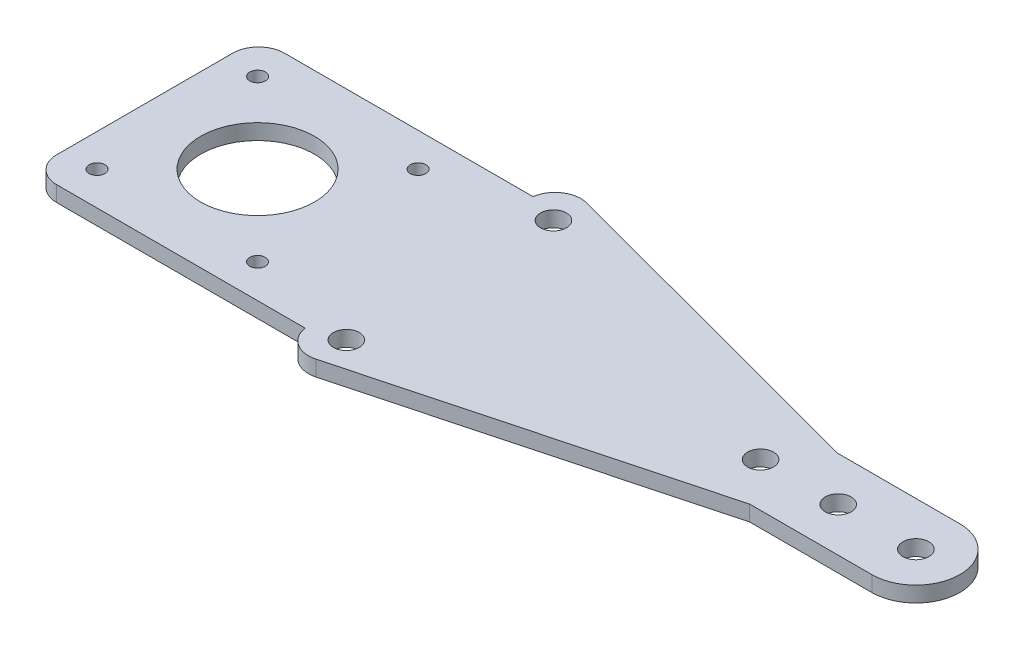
ISO-10303-21;
HEADER;
FILE_DESCRIPTION(('STEP AP214'),'2;1');
FILE_NAME('part.step','',(''),(''),'','','');
FILE_SCHEMA(('AUTOMOTIVE_DESIGN { 1 0 10303 214 1 1 1 1 }'));
ENDSEC;
DATA;
#1=APPLICATION_CONTEXT('core data for automotive mechanical design processes');
#2=APPLICATION_PROTOCOL_DEFINITION('international standard','automotive_design',2000,#1);
#3=PRODUCT_CONTEXT('',#1,'mechanical');
#4=PRODUCT('Part','Part','',(#3));
#5=PRODUCT_RELATED_PRODUCT_CATEGORY('part','',(#4));
#6=PRODUCT_DEFINITION_FORMATION('','',#4);
#7=PRODUCT_DEFINITION_CONTEXT('part definition',#1,'design');
#8=PRODUCT_DEFINITION('design','',#6,#7);
#9=PRODUCT_DEFINITION_SHAPE('','',#8);
#10=(LENGTH_UNIT() NAMED_UNIT(*) SI_UNIT(.MILLI.,.METRE.));
#11=(NAMED_UNIT(*) PLANE_ANGLE_UNIT() SI_UNIT($,.RADIAN.));
#12=(NAMED_UNIT(*) SI_UNIT($,.STERADIAN.) SOLID_ANGLE_UNIT());
#13=UNCERTAINTY_MEASURE_WITH_UNIT(LENGTH_MEASURE(1.E-05),#10,'distance_accuracy_value','');
#14=(GEOMETRIC_REPRESENTATION_CONTEXT(3) GLOBAL_UNCERTAINTY_ASSIGNED_CONTEXT((#13)) GLOBAL_UNIT_ASSIGNED_CONTEXT((#10,
#11,#12)) REPRESENTATION_CONTEXT('',''));
#15=CARTESIAN_POINT('',(0.,0.,0.));
#16=DIRECTION('',(0.,0.,1.));
#17=DIRECTION('',(1.,0.,0.));
#18=AXIS2_PLACEMENT_3D('',#15,#16,#17);
#19=CARTESIAN_POINT('',(-38.5,3.,21.3016116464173));
#20=DIRECTION('',(0.,-1.,0.));
#21=DIRECTION('',(0.,0.,-1.));
#22=AXIS2_PLACEMENT_3D('',#19,#20,#21);
#23=PLANE('',#22);
#24=CARTESIAN_POINT('',(-59.1500000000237,3.,15.5));
#25=DIRECTION('',(0.,1.,0.));
#26=DIRECTION('',(0.,0.,1.));
#27=AXIS2_PLACEMENT_3D('',#24,#25,#26);
#28=CIRCLE('',#27,1.5);
#29=CARTESIAN_POINT('',(-59.1500000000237,3.,17.));
#30=VERTEX_POINT('',#29);
#31=EDGE_CURVE('E218',#30,#30,#28,.F.);
#32=ORIENTED_EDGE('',*,*,#31,.T.);
#33=EDGE_LOOP('',(#32));
#34=FACE_BOUND('',#33,.T.);
#35=CARTESIAN_POINT('',(-90.1500000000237,3.,15.5000000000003));
#36=DIRECTION('',(0.,1.,0.));
#37=DIRECTION('',(0.,0.,1.));
#38=AXIS2_PLACEMENT_3D('',#35,#36,#37);
#39=CIRCLE('',#38,1.5);
#40=CARTESIAN_POINT('',(-90.1500000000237,3.,17.0000000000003));
#41=VERTEX_POINT('',#40);
#42=EDGE_CURVE('E221',#41,#41,#39,.F.);
#43=ORIENTED_EDGE('',*,*,#42,.T.);
#44=EDGE_LOOP('',(#43));
#45=FACE_BOUND('',#44,.T.);
#46=CARTESIAN_POINT('',(-90.1500000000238,3.,-15.4999999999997));
#47=DIRECTION('',(0.,1.,0.));
#48=DIRECTION('',(0.,0.,1.));
#49=AXIS2_PLACEMENT_3D('',#46,#47,#48);
#50=CIRCLE('',#49,1.5);
#51=CARTESIAN_POINT('',(-90.1500000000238,3.,-13.9999999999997));
#52=VERTEX_POINT('',#51);
#53=EDGE_CURVE('E224',#52,#52,#50,.F.);
#54=ORIENTED_EDGE('',*,*,#53,.T.);
#55=EDGE_LOOP('',(#54));
#56=FACE_BOUND('',#55,.T.);
#57=CARTESIAN_POINT('',(-59.1500000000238,3.,-15.5));
#58=DIRECTION('',(0.,1.,0.));
#59=DIRECTION('',(0.,0.,1.));
#60=AXIS2_PLACEMENT_3D('',#57,#58,#59);
#61=CIRCLE('',#60,1.5);
#62=CARTESIAN_POINT('',(-59.1500000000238,3.,-14.));
#63=VERTEX_POINT('',#62);
#64=EDGE_CURVE('E227',#63,#63,#61,.F.);
#65=ORIENTED_EDGE('',*,*,#64,.T.);
#66=EDGE_LOOP('',(#65));
#67=FACE_BOUND('',#66,.T.);
#68=CARTESIAN_POINT('',(-74.6500000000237,3.,2.20418749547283E-13));
#69=DIRECTION('',(0.,1.,0.));
#70=DIRECTION('',(0.,0.,1.));
#71=AXIS2_PLACEMENT_3D('',#68,#69,#70);
#72=CIRCLE('',#71,11.);
#73=CARTESIAN_POINT('',(-74.6500000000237,3.,11.0000000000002));
#74=VERTEX_POINT('',#73);
#75=EDGE_CURVE('E230',#74,#74,#72,.F.);
#76=ORIENTED_EDGE('',*,*,#75,.T.);
#77=EDGE_LOOP('',(#76));
#78=FACE_BOUND('',#77,.T.);
#79=CARTESIAN_POINT('',(52.5,3.,0.));
#80=DIRECTION('',(0.,-1.,0.));
#81=DIRECTION('',(0.,0.,-1.));
#82=AXIS2_PLACEMENT_3D('',#79,#80,#81);
#83=CIRCLE('',#82,2.5);
#84=CARTESIAN_POINT('',(52.5,3.,-2.5));
#85=VERTEX_POINT('',#84);
#86=EDGE_CURVE('E233',#85,#85,#83,.T.);
#87=ORIENTED_EDGE('',*,*,#86,.T.);
#88=EDGE_LOOP('',(#87));
#89=FACE_BOUND('',#88,.T.);
#90=CARTESIAN_POINT('',(22.5,3.,0.));
#91=DIRECTION('',(0.,-1.,0.));
#92=DIRECTION('',(0.,0.,-1.));
#93=AXIS2_PLACEMENT_3D('',#90,#91,#92);
#94=CIRCLE('',#93,2.5);
#95=CARTESIAN_POINT('',(22.5,3.,-2.5));
#96=VERTEX_POINT('',#95);
#97=EDGE_CURVE('E245',#96,#96,#94,.T.);
#98=ORIENTED_EDGE('',*,*,#97,.T.);
#99=EDGE_LOOP('',(#98));
#100=FACE_BOUND('',#99,.T.);
#101=CARTESIAN_POINT('',(-37.5,3.,20.));
#102=DIRECTION('',(0.,-1.,0.));
#103=DIRECTION('',(0.,0.,-1.));
#104=AXIS2_PLACEMENT_3D('',#101,#102,#103);
#105=CIRCLE('',#104,2.5);
#106=CARTESIAN_POINT('',(-37.5,3.,17.5));
#107=VERTEX_POINT('',#106);
#108=EDGE_CURVE('E236',#107,#107,#105,.T.);
#109=ORIENTED_EDGE('',*,*,#108,.T.);
#110=EDGE_LOOP('',(#109));
#111=FACE_BOUND('',#110,.T.);
#112=CARTESIAN_POINT('',(37.5,3.,0.));
#113=DIRECTION('',(0.,-1.,0.));
#114=DIRECTION('',(0.,0.,-1.));
#115=AXIS2_PLACEMENT_3D('',#112,#113,#114);
#116=CIRCLE('',#115,2.5);
#117=CARTESIAN_POINT('',(37.5,3.,-2.5));
#118=VERTEX_POINT('',#117);
#119=EDGE_CURVE('E242',#118,#118,#116,.T.);
#120=ORIENTED_EDGE('',*,*,#119,.T.);
#121=EDGE_LOOP('',(#120));
#122=FACE_BOUND('',#121,.T.);
#123=CARTESIAN_POINT('',(-37.5,3.,-20.));
#124=DIRECTION('',(0.,-1.,0.));
#125=DIRECTION('',(0.,0.,-1.));
#126=AXIS2_PLACEMENT_3D('',#123,#124,#125);
#127=CIRCLE('',#126,2.5);
#128=CARTESIAN_POINT('',(-37.5,3.,-22.5));
#129=VERTEX_POINT('',#128);
#130=EDGE_CURVE('E239',#129,#129,#127,.T.);
#131=ORIENTED_EDGE('',*,*,#130,.T.);
#132=EDGE_LOOP('',(#131));
#133=FACE_BOUND('',#132,.T.);
#134=CARTESIAN_POINT('',(-91.4509851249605,3.,17.));
#135=DIRECTION('',(0.,1.,0.));
#136=DIRECTION('',(0.,0.,1.));
#137=AXIS2_PLACEMENT_3D('',#134,#135,#136);
#138=CIRCLE('',#137,5.);
#139=CARTESIAN_POINT('',(-91.4509851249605,3.,22.));
#140=VERTEX_POINT('',#139);
#141=CARTESIAN_POINT('',(-96.4509851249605,3.,17.));
#142=VERTEX_POINT('',#141);
#143=EDGE_CURVE('E20',#140,#142,#138,.F.);
#144=ORIENTED_EDGE('',*,*,#143,.F.);
#145=DIRECTION('',(1.,0.,0.));
#146=VECTOR('',#145,1.);
#147=CARTESIAN_POINT('',(0.,3.,22.));
#148=LINE('',#147,#146);
#149=CARTESIAN_POINT('',(-43.4509851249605,3.,22.));
#150=VERTEX_POINT('',#149);
#151=EDGE_CURVE('E152',#150,#140,#148,.F.);
#152=ORIENTED_EDGE('',*,*,#151,.F.);
#153=CARTESIAN_POINT('',(-38.5,3.,21.3016116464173));
#154=DIRECTION('',(0.,-1.,0.));
#155=DIRECTION('',(0.,0.,-1.));
#156=AXIS2_PLACEMENT_3D('',#153,#154,#155);
#157=CIRCLE('',#156,5.);
#158=CARTESIAN_POINT('',(-37.2116867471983,3.,26.1327863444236));
#159=VERTEX_POINT('',#158);
#160=EDGE_CURVE('E248',#159,#150,#157,.T.);
#161=ORIENTED_EDGE('',*,*,#160,.F.);
#162=DIRECTION('',(-0.966234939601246,0.,0.257662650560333));
#163=VECTOR('',#162,1.);
#164=CARTESIAN_POINT('',(28.91126204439,3.,8.5));
#165=LINE('',#164,#163);
#166=CARTESIAN_POINT('',(28.91126204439,3.,8.5));
#167=VERTEX_POINT('',#166);
#168=EDGE_CURVE('E153',#159,#167,#165,.F.);
#169=ORIENTED_EDGE('',*,*,#168,.T.);
#170=DIRECTION('',(-1.,0.,0.));
#171=VECTOR('',#170,1.);
#172=CARTESIAN_POINT('',(52.5,3.,8.5));
#173=LINE('',#172,#171);
#174=CARTESIAN_POINT('',(52.5,3.,8.5));
#175=VERTEX_POINT('',#174);
#176=EDGE_CURVE('E161',#167,#175,#173,.F.);
#177=ORIENTED_EDGE('',*,*,#176,.T.);
#178=CARTESIAN_POINT('',(52.5,3.,0.));
#179=DIRECTION('',(0.,-1.,0.));
#180=DIRECTION('',(0.,0.,-1.));
#181=AXIS2_PLACEMENT_3D('',#178,#179,#180);
#182=CIRCLE('',#181,8.5);
#183=CARTESIAN_POINT('',(52.5,3.,-8.5));
#184=VERTEX_POINT('',#183);
#185=EDGE_CURVE('E111',#184,#175,#182,.T.);
#186=ORIENTED_EDGE('',*,*,#185,.F.);
#187=DIRECTION('',(1.,0.,0.));
#188=VECTOR('',#187,1.);
#189=CARTESIAN_POINT('',(52.5,3.,-8.5));
#190=LINE('',#189,#188);
#191=CARTESIAN_POINT('',(28.9112620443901,3.,-8.5));
#192=VERTEX_POINT('',#191);
#193=EDGE_CURVE('E105',#184,#192,#190,.F.);
#194=ORIENTED_EDGE('',*,*,#193,.T.);
#195=DIRECTION('',(0.966234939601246,0.,0.257662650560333));
#196=VECTOR('',#195,1.);
#197=CARTESIAN_POINT('',(-37.2116867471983,3.,-26.1327863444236));
#198=LINE('',#197,#196);
#199=CARTESIAN_POINT('',(-37.2116867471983,3.,-26.1327863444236));
#200=VERTEX_POINT('',#199);
#201=EDGE_CURVE('E108',#192,#200,#198,.F.);
#202=ORIENTED_EDGE('',*,*,#201,.T.);
#203=CARTESIAN_POINT('',(-38.5,3.,-21.3016116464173));
#204=DIRECTION('',(0.,-1.,0.));
#205=DIRECTION('',(0.,0.,-1.));
#206=AXIS2_PLACEMENT_3D('',#203,#204,#205);
#207=CIRCLE('',#206,5.);
#208=CARTESIAN_POINT('',(-43.4509851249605,3.,-22.));
#209=VERTEX_POINT('',#208);
#210=EDGE_CURVE('E100',#209,#200,#207,.T.);
#211=ORIENTED_EDGE('',*,*,#210,.F.);
#212=DIRECTION('',(1.,0.,0.));
#213=VECTOR('',#212,1.);
#214=CARTESIAN_POINT('',(0.,3.,-22.));
#215=LINE('',#214,#213);
#216=CARTESIAN_POINT('',(-91.4509851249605,3.,-22.));
#217=VERTEX_POINT('',#216);
#218=EDGE_CURVE('E140',#209,#217,#215,.F.);
#219=ORIENTED_EDGE('',*,*,#218,.T.);
#220=CARTESIAN_POINT('',(-91.4509851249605,3.,-17.));
#221=DIRECTION('',(0.,-1.,0.));
#222=DIRECTION('',(0.,0.,-1.));
#223=AXIS2_PLACEMENT_3D('',#220,#221,#222);
#224=CIRCLE('',#223,5.);
#225=CARTESIAN_POINT('',(-96.4509851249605,3.,-17.));
#226=VERTEX_POINT('',#225);
#227=EDGE_CURVE('E144',#226,#217,#224,.T.);
#228=ORIENTED_EDGE('',*,*,#227,.F.);
#229=DIRECTION('',(0.,0.,1.));
#230=VECTOR('',#229,1.);
#231=CARTESIAN_POINT('',(-96.4509851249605,3.,0.));
#232=LINE('',#231,#230);
#233=EDGE_CURVE('E145',#142,#226,#232,.F.);
#234=ORIENTED_EDGE('',*,*,#233,.F.);
#235=EDGE_LOOP('',(#144,#152,#161,#169,#177,#186,#194,#202,#211,#219,#228,#234));
#236=FACE_BOUND('',#235,.T.);
#237=ADVANCED_FACE('F17',(#34,#45,#56,#67,#78,#89,#100,#111,#122,#133,#236),#23,.F.);
#238=CARTESIAN_POINT('',(0.,0.,22.));
#239=DIRECTION('',(0.,0.,1.));
#240=DIRECTION('',(0.,-1.,0.));
#241=AXIS2_PLACEMENT_3D('',#238,#239,#240);
#242=PLANE('',#241);
#243=DIRECTION('',(1.,0.,0.));
#244=VECTOR('',#243,1.);
#245=CARTESIAN_POINT('',(-38.5,0.,22.));
#246=LINE('',#245,#244);
#247=CARTESIAN_POINT('',(-43.4509851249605,0.,22.));
#248=VERTEX_POINT('',#247);
#249=CARTESIAN_POINT('',(-91.4509851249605,0.,22.));
#250=VERTEX_POINT('',#249);
#251=EDGE_CURVE('E217',#248,#250,#246,.F.);
#252=ORIENTED_EDGE('',*,*,#251,.F.);
#253=DIRECTION('',(0.,-1.,0.));
#254=VECTOR('',#253,1.);
#255=CARTESIAN_POINT('',(-43.4509851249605,3.,22.));
#256=LINE('',#255,#254);
#257=EDGE_CURVE('E251',#150,#248,#256,.T.);
#258=ORIENTED_EDGE('',*,*,#257,.F.);
#259=ORIENTED_EDGE('',*,*,#151,.T.);
#260=DIRECTION('',(0.,1.,0.));
#261=VECTOR('',#260,1.);
#262=CARTESIAN_POINT('',(-91.4509851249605,0.,22.));
#263=LINE('',#262,#261);
#264=EDGE_CURVE('E149',#250,#140,#263,.T.);
#265=ORIENTED_EDGE('',*,*,#264,.F.);
#266=EDGE_LOOP('',(#252,#258,#259,#265));
#267=FACE_BOUND('',#266,.T.);
#268=ADVANCED_FACE('F513',(#267),#242,.T.);
#269=CARTESIAN_POINT('',(-91.4509851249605,0.,17.));
#270=DIRECTION('',(0.,1.,0.));
#271=DIRECTION('',(0.,0.,1.));
#272=AXIS2_PLACEMENT_3D('',#269,#270,#271);
#273=CYLINDRICAL_SURFACE('',#272,5.);
#274=ORIENTED_EDGE('',*,*,#143,.T.);
#275=DIRECTION('',(0.,1.,0.));
#276=VECTOR('',#275,1.);
#277=CARTESIAN_POINT('',(-96.4509851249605,0.,17.));
#278=LINE('',#277,#276);
#279=CARTESIAN_POINT('',(-96.4509851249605,0.,17.));
#280=VERTEX_POINT('',#279);
#281=EDGE_CURVE('E146',#280,#142,#278,.T.);
#282=ORIENTED_EDGE('',*,*,#281,.F.);
#283=CARTESIAN_POINT('',(-91.4509851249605,0.,17.));
#284=DIRECTION('',(0.,1.,0.));
#285=DIRECTION('',(0.,0.,1.));
#286=AXIS2_PLACEMENT_3D('',#283,#284,#285);
#287=CIRCLE('',#286,5.);
#288=EDGE_CURVE('E214',#250,#280,#287,.F.);
#289=ORIENTED_EDGE('',*,*,#288,.F.);
#290=ORIENTED_EDGE('',*,*,#264,.T.);
#291=EDGE_LOOP('',(#274,#282,#289,#290));
#292=FACE_BOUND('',#291,.T.);
#293=ADVANCED_FACE('F505',(#292),#273,.T.);
#294=CARTESIAN_POINT('',(-96.4509851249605,0.,0.));
#295=DIRECTION('',(-1.,0.,0.));
#296=DIRECTION('',(0.,0.,1.));
#297=AXIS2_PLACEMENT_3D('',#294,#295,#296);
#298=PLANE('',#297);
#299=ORIENTED_EDGE('',*,*,#233,.T.);
#300=DIRECTION('',(0.,-1.,0.));
#301=VECTOR('',#300,1.);
#302=CARTESIAN_POINT('',(-96.4509851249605,0.,-17.));
#303=LINE('',#302,#301);
#304=CARTESIAN_POINT('',(-96.4509851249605,0.,-17.));
#305=VERTEX_POINT('',#304);
#306=EDGE_CURVE('E141',#305,#226,#303,.F.);
#307=ORIENTED_EDGE('',*,*,#306,.F.);
#308=DIRECTION('',(0.,0.,-1.));
#309=VECTOR('',#308,1.);
#310=CARTESIAN_POINT('',(-96.4509851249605,0.,21.3016116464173));
#311=LINE('',#310,#309);
#312=EDGE_CURVE('E213',#280,#305,#311,.T.);
#313=ORIENTED_EDGE('',*,*,#312,.F.);
#314=ORIENTED_EDGE('',*,*,#281,.T.);
#315=EDGE_LOOP('',(#299,#307,#313,#314));
#316=FACE_BOUND('',#315,.T.);
#317=ADVANCED_FACE('F497',(#316),#298,.T.);
#318=CARTESIAN_POINT('',(-91.4509851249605,0.,-17.));
#319=DIRECTION('',(0.,-1.,0.));
#320=DIRECTION('',(0.,0.,-1.));
#321=AXIS2_PLACEMENT_3D('',#318,#319,#320);
#322=CYLINDRICAL_SURFACE('',#321,5.);
#323=ORIENTED_EDGE('',*,*,#227,.T.);
#324=DIRECTION('',(0.,1.,0.));
#325=VECTOR('',#324,1.);
#326=CARTESIAN_POINT('',(-91.4509851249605,0.,-22.));
#327=LINE('',#326,#325);
#328=CARTESIAN_POINT('',(-91.4509851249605,0.,-22.));
#329=VERTEX_POINT('',#328);
#330=EDGE_CURVE('E138',#217,#329,#327,.F.);
#331=ORIENTED_EDGE('',*,*,#330,.T.);
#332=CARTESIAN_POINT('',(-91.4509851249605,0.,-17.));
#333=DIRECTION('',(0.,-1.,0.));
#334=DIRECTION('',(0.,0.,-1.));
#335=AXIS2_PLACEMENT_3D('',#332,#333,#334);
#336=CIRCLE('',#335,5.);
#337=EDGE_CURVE('E210',#305,#329,#336,.T.);
#338=ORIENTED_EDGE('',*,*,#337,.F.);
#339=ORIENTED_EDGE('',*,*,#306,.T.);
#340=EDGE_LOOP('',(#323,#331,#338,#339));
#341=FACE_BOUND('',#340,.T.);
#342=ADVANCED_FACE('F257',(#341),#322,.T.);
#343=CARTESIAN_POINT('',(0.,0.,-22.));
#344=DIRECTION('',(0.,0.,1.));
#345=DIRECTION('',(1.,0.,0.));
#346=AXIS2_PLACEMENT_3D('',#343,#344,#345);
#347=PLANE('',#346);
#348=ORIENTED_EDGE('',*,*,#330,.F.);
#349=ORIENTED_EDGE('',*,*,#218,.F.);
#350=DIRECTION('',(0.,-1.,0.));
#351=VECTOR('',#350,1.);
#352=CARTESIAN_POINT('',(-43.4509851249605,3.,-22.));
#353=LINE('',#352,#351);
#354=CARTESIAN_POINT('',(-43.4509851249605,0.,-22.));
#355=VERTEX_POINT('',#354);
#356=EDGE_CURVE('E123',#355,#209,#353,.F.);
#357=ORIENTED_EDGE('',*,*,#356,.F.);
#358=DIRECTION('',(1.,0.,0.));
#359=VECTOR('',#358,1.);
#360=CARTESIAN_POINT('',(-38.5,0.,-22.));
#361=LINE('',#360,#359);
#362=EDGE_CURVE('E209',#329,#355,#361,.T.);
#363=ORIENTED_EDGE('',*,*,#362,.F.);
#364=EDGE_LOOP('',(#348,#349,#357,#363));
#365=FACE_BOUND('',#364,.T.);
#366=ADVANCED_FACE('F263',(#365),#347,.F.);
#367=CARTESIAN_POINT('',(-38.5,3.,-21.3016116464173));
#368=DIRECTION('',(0.,-1.,0.));
#369=DIRECTION('',(0.,0.,-1.));
#370=AXIS2_PLACEMENT_3D('',#367,#368,#369);
#371=CYLINDRICAL_SURFACE('',#370,5.);
#372=CARTESIAN_POINT('',(-38.5,0.,-21.3016116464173));
#373=DIRECTION('',(0.,-1.,0.));
#374=DIRECTION('',(0.,0.,-1.));
#375=AXIS2_PLACEMENT_3D('',#372,#373,#374);
#376=CIRCLE('',#375,5.);
#377=CARTESIAN_POINT('',(-37.2116867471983,0.,-26.1327863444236));
#378=VERTEX_POINT('',#377);
#379=EDGE_CURVE('E205',#355,#378,#376,.T.);
#380=ORIENTED_EDGE('',*,*,#379,.F.);
#381=ORIENTED_EDGE('',*,*,#356,.T.);
#382=ORIENTED_EDGE('',*,*,#210,.T.);
#383=DIRECTION('',(0.,1.,0.));
#384=VECTOR('',#383,1.);
#385=CARTESIAN_POINT('',(-37.2116867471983,3.,-26.1327863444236));
#386=LINE('',#385,#384);
#387=EDGE_CURVE('E116',#200,#378,#386,.F.);
#388=ORIENTED_EDGE('',*,*,#387,.T.);
#389=EDGE_LOOP('',(#380,#381,#382,#388));
#390=FACE_BOUND('',#389,.T.);
#391=ADVANCED_FACE('F307',(#390),#371,.T.);
#392=CARTESIAN_POINT('',(-37.2116867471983,3.,-26.1327863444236));
#393=DIRECTION('',(-0.257662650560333,0.,0.966234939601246));
#394=DIRECTION('',(0.966234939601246,0.,0.257662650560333));
#395=AXIS2_PLACEMENT_3D('',#392,#393,#394);
#396=PLANE('',#395);
#397=ORIENTED_EDGE('',*,*,#387,.F.);
#398=ORIENTED_EDGE('',*,*,#201,.F.);
#399=DIRECTION('',(0.,-1.,0.));
#400=VECTOR('',#399,1.);
#401=CARTESIAN_POINT('',(28.91126204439,3.,-8.5));
#402=LINE('',#401,#400);
#403=CARTESIAN_POINT('',(28.91126204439,0.,-8.5));
#404=VERTEX_POINT('',#403);
#405=EDGE_CURVE('E115',#192,#404,#402,.T.);
#406=ORIENTED_EDGE('',*,*,#405,.T.);
#407=DIRECTION('',(0.966234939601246,0.,0.257662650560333));
#408=VECTOR('',#407,1.);
#409=CARTESIAN_POINT('',(-37.2116867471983,0.,-26.1327863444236));
#410=LINE('',#409,#408);
#411=EDGE_CURVE('E208',#378,#404,#410,.T.);
#412=ORIENTED_EDGE('',*,*,#411,.F.);
#413=EDGE_LOOP('',(#397,#398,#406,#412));
#414=FACE_BOUND('',#413,.T.);
#415=ADVANCED_FACE('F120',(#414),#396,.F.);
#416=CARTESIAN_POINT('',(52.5,3.,-8.5));
#417=DIRECTION('',(0.,0.,1.));
#418=DIRECTION('',(0.,-1.,0.));
#419=AXIS2_PLACEMENT_3D('',#416,#417,#418);
#420=PLANE('',#419);
#421=ORIENTED_EDGE('',*,*,#405,.F.);
#422=ORIENTED_EDGE('',*,*,#193,.F.);
#423=DIRECTION('',(0.,-1.,0.));
#424=VECTOR('',#423,1.);
#425=CARTESIAN_POINT('',(52.5,3.,-8.5));
#426=LINE('',#425,#424);
#427=CARTESIAN_POINT('',(52.5,0.,-8.5));
#428=VERTEX_POINT('',#427);
#429=EDGE_CURVE('E129',#428,#184,#426,.F.);
#430=ORIENTED_EDGE('',*,*,#429,.F.);
#431=DIRECTION('',(1.,0.,0.));
#432=VECTOR('',#431,1.);
#433=CARTESIAN_POINT('',(-38.5,0.,-8.5));
#434=LINE('',#433,#432);
#435=EDGE_CURVE('E127',#404,#428,#434,.T.);
#436=ORIENTED_EDGE('',*,*,#435,.F.);
#437=EDGE_LOOP('',(#421,#422,#430,#436));
#438=FACE_BOUND('',#437,.T.);
#439=ADVANCED_FACE('F125',(#438),#420,.F.);
#440=CARTESIAN_POINT('',(52.5,3.,0.));
#441=DIRECTION('',(0.,-1.,0.));
#442=DIRECTION('',(0.,0.,-1.));
#443=AXIS2_PLACEMENT_3D('',#440,#441,#442);
#444=CYLINDRICAL_SURFACE('',#443,8.5);
#445=ORIENTED_EDGE('',*,*,#185,.T.);
#446=DIRECTION('',(0.,1.,0.));
#447=VECTOR('',#446,1.);
#448=CARTESIAN_POINT('',(52.5,3.,8.5));
#449=LINE('',#448,#447);
#450=CARTESIAN_POINT('',(52.5,0.,8.5));
#451=VERTEX_POINT('',#450);
#452=EDGE_CURVE('E157',#175,#451,#449,.F.);
#453=ORIENTED_EDGE('',*,*,#452,.T.);
#454=CARTESIAN_POINT('',(52.5,0.,0.));
#455=DIRECTION('',(0.,-1.,0.));
#456=DIRECTION('',(0.,0.,-1.));
#457=AXIS2_PLACEMENT_3D('',#454,#455,#456);
#458=CIRCLE('',#457,8.5);
#459=EDGE_CURVE('E201',#428,#451,#458,.T.);
#460=ORIENTED_EDGE('',*,*,#459,.F.);
#461=ORIENTED_EDGE('',*,*,#429,.T.);
#462=EDGE_LOOP('',(#445,#453,#460,#461));
#463=FACE_BOUND('',#462,.T.);
#464=ADVANCED_FACE('F288',(#463),#444,.T.);
#465=CARTESIAN_POINT('',(52.5,3.,8.5));
#466=DIRECTION('',(0.,0.,-1.));
#467=DIRECTION('',(-1.,0.,0.));
#468=AXIS2_PLACEMENT_3D('',#465,#466,#467);
#469=PLANE('',#468);
#470=ORIENTED_EDGE('',*,*,#452,.F.);
#471=ORIENTED_EDGE('',*,*,#176,.F.);
#472=DIRECTION('',(0.,1.,0.));
#473=VECTOR('',#472,1.);
#474=CARTESIAN_POINT('',(28.91126204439,3.,8.5));
#475=LINE('',#474,#473);
#476=CARTESIAN_POINT('',(28.9112620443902,0.,8.49999999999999));
#477=VERTEX_POINT('',#476);
#478=EDGE_CURVE('E156',#167,#477,#475,.F.);
#479=ORIENTED_EDGE('',*,*,#478,.T.);
#480=DIRECTION('',(1.,0.,0.));
#481=VECTOR('',#480,1.);
#482=CARTESIAN_POINT('',(-38.5,0.,8.5));
#483=LINE('',#482,#481);
#484=EDGE_CURVE('E204',#451,#477,#483,.F.);
#485=ORIENTED_EDGE('',*,*,#484,.F.);
#486=EDGE_LOOP('',(#470,#471,#479,#485));
#487=FACE_BOUND('',#486,.T.);
#488=ADVANCED_FACE('F292',(#487),#469,.F.);
#489=CARTESIAN_POINT('',(28.91126204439,3.,8.5));
#490=DIRECTION('',(-0.257662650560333,0.,-0.966234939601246));
#491=DIRECTION('',(-0.966234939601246,0.,0.257662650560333));
#492=AXIS2_PLACEMENT_3D('',#489,#490,#491);
#493=PLANE('',#492);
#494=ORIENTED_EDGE('',*,*,#478,.F.);
#495=ORIENTED_EDGE('',*,*,#168,.F.);
#496=DIRECTION('',(0.,-1.,0.));
#497=VECTOR('',#496,1.);
#498=CARTESIAN_POINT('',(-37.2116867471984,3.,26.1327863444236));
#499=LINE('',#498,#497);
#500=CARTESIAN_POINT('',(-37.2116867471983,0.,26.1327863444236));
#501=VERTEX_POINT('',#500);
#502=EDGE_CURVE('E35',#501,#159,#499,.F.);
#503=ORIENTED_EDGE('',*,*,#502,.F.);
#504=DIRECTION('',(-0.966234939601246,0.,0.257662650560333));
#505=VECTOR('',#504,1.);
#506=CARTESIAN_POINT('',(28.91126204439,0.,8.5));
#507=LINE('',#506,#505);
#508=EDGE_CURVE('E200',#477,#501,#507,.T.);
#509=ORIENTED_EDGE('',*,*,#508,.F.);
#510=EDGE_LOOP('',(#494,#495,#503,#509));
#511=FACE_BOUND('',#510,.T.);
#512=ADVANCED_FACE('F305',(#511),#493,.F.);
#513=CARTESIAN_POINT('',(-38.5,3.,21.3016116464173));
#514=DIRECTION('',(0.,-1.,0.));
#515=DIRECTION('',(0.,0.,-1.));
#516=AXIS2_PLACEMENT_3D('',#513,#514,#515);
#517=CYLINDRICAL_SURFACE('',#516,5.);
#518=CARTESIAN_POINT('',(-38.5,0.,21.3016116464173));
#519=DIRECTION('',(0.,-1.,0.));
#520=DIRECTION('',(0.,0.,-1.));
#521=AXIS2_PLACEMENT_3D('',#518,#519,#520);
#522=CIRCLE('',#521,5.);
#523=EDGE_CURVE('E197',#501,#248,#522,.T.);
#524=ORIENTED_EDGE('',*,*,#523,.F.);
#525=ORIENTED_EDGE('',*,*,#502,.T.);
#526=ORIENTED_EDGE('',*,*,#160,.T.);
#527=ORIENTED_EDGE('',*,*,#257,.T.);
#528=EDGE_LOOP('',(#524,#525,#526,#527));
#529=FACE_BOUND('',#528,.T.);
#530=ADVANCED_FACE('F363',(#529),#517,.T.);
#531=CARTESIAN_POINT('',(22.5,3.,0.));
#532=DIRECTION('',(0.,-1.,0.));
#533=DIRECTION('',(0.,0.,-1.));
#534=AXIS2_PLACEMENT_3D('',#531,#532,#533);
#535=CYLINDRICAL_SURFACE('',#534,2.5);
#536=ORIENTED_EDGE('',*,*,#97,.F.);
#537=EDGE_LOOP('',(#536));
#538=FACE_BOUND('',#537,.T.);
#539=CARTESIAN_POINT('',(22.5,0.,0.));
#540=DIRECTION('',(0.,-1.,0.));
#541=DIRECTION('',(0.,0.,-1.));
#542=AXIS2_PLACEMENT_3D('',#539,#540,#541);
#543=CIRCLE('',#542,2.5);
#544=CARTESIAN_POINT('',(22.5,0.,-2.5));
#545=VERTEX_POINT('',#544);
#546=EDGE_CURVE('E194',#545,#545,#543,.F.);
#547=ORIENTED_EDGE('',*,*,#546,.F.);
#548=EDGE_LOOP('',(#547));
#549=FACE_BOUND('',#548,.T.);
#550=ADVANCED_FACE('F359',(#538,#549),#535,.F.);
#551=CARTESIAN_POINT('',(37.5,3.,0.));
#552=DIRECTION('',(0.,-1.,0.));
#553=DIRECTION('',(0.,0.,-1.));
#554=AXIS2_PLACEMENT_3D('',#551,#552,#553);
#555=CYLINDRICAL_SURFACE('',#554,2.5);
#556=ORIENTED_EDGE('',*,*,#119,.F.);
#557=EDGE_LOOP('',(#556));
#558=FACE_BOUND('',#557,.T.);
#559=CARTESIAN_POINT('',(37.5,0.,0.));
#560=DIRECTION('',(0.,-1.,0.));
#561=DIRECTION('',(0.,0.,-1.));
#562=AXIS2_PLACEMENT_3D('',#559,#560,#561);
#563=CIRCLE('',#562,2.5);
#564=CARTESIAN_POINT('',(37.5,0.,-2.5));
#565=VERTEX_POINT('',#564);
#566=EDGE_CURVE('E191',#565,#565,#563,.F.);
#567=ORIENTED_EDGE('',*,*,#566,.F.);
#568=EDGE_LOOP('',(#567));
#569=FACE_BOUND('',#568,.T.);
#570=ADVANCED_FACE('F355',(#558,#569),#555,.F.);
#571=CARTESIAN_POINT('',(-37.5,3.,-20.));
#572=DIRECTION('',(0.,-1.,0.));
#573=DIRECTION('',(0.,0.,-1.));
#574=AXIS2_PLACEMENT_3D('',#571,#572,#573);
#575=CYLINDRICAL_SURFACE('',#574,2.5);
#576=ORIENTED_EDGE('',*,*,#130,.F.);
#577=EDGE_LOOP('',(#576));
#578=FACE_BOUND('',#577,.T.);
#579=CARTESIAN_POINT('',(-37.5,0.,-20.));
#580=DIRECTION('',(0.,-1.,0.));
#581=DIRECTION('',(0.,0.,-1.));
#582=AXIS2_PLACEMENT_3D('',#579,#580,#581);
#583=CIRCLE('',#582,2.5);
#584=CARTESIAN_POINT('',(-37.5,0.,-22.5));
#585=VERTEX_POINT('',#584);
#586=EDGE_CURVE('E188',#585,#585,#583,.F.);
#587=ORIENTED_EDGE('',*,*,#586,.F.);
#588=EDGE_LOOP('',(#587));
#589=FACE_BOUND('',#588,.T.);
#590=ADVANCED_FACE('F351',(#578,#589),#575,.F.);
#591=CARTESIAN_POINT('',(-37.5,3.,20.));
#592=DIRECTION('',(0.,-1.,0.));
#593=DIRECTION('',(0.,0.,-1.));
#594=AXIS2_PLACEMENT_3D('',#591,#592,#593);
#595=CYLINDRICAL_SURFACE('',#594,2.5);
#596=ORIENTED_EDGE('',*,*,#108,.F.);
#597=EDGE_LOOP('',(#596));
#598=FACE_BOUND('',#597,.T.);
#599=CARTESIAN_POINT('',(-37.5,0.,20.));
#600=DIRECTION('',(0.,-1.,0.));
#601=DIRECTION('',(0.,0.,-1.));
#602=AXIS2_PLACEMENT_3D('',#599,#600,#601);
#603=CIRCLE('',#602,2.5);
#604=CARTESIAN_POINT('',(-37.5,0.,17.5));
#605=VERTEX_POINT('',#604);
#606=EDGE_CURVE('E185',#605,#605,#603,.F.);
#607=ORIENTED_EDGE('',*,*,#606,.F.);
#608=EDGE_LOOP('',(#607));
#609=FACE_BOUND('',#608,.T.);
#610=ADVANCED_FACE('F347',(#598,#609),#595,.F.);
#611=CARTESIAN_POINT('',(52.5,3.,0.));
#612=DIRECTION('',(0.,-1.,0.));
#613=DIRECTION('',(0.,0.,-1.));
#614=AXIS2_PLACEMENT_3D('',#611,#612,#613);
#615=CYLINDRICAL_SURFACE('',#614,2.5);
#616=ORIENTED_EDGE('',*,*,#86,.F.);
#617=EDGE_LOOP('',(#616));
#618=FACE_BOUND('',#617,.T.);
#619=CARTESIAN_POINT('',(52.5,0.,0.));
#620=DIRECTION('',(0.,-1.,0.));
#621=DIRECTION('',(0.,0.,-1.));
#622=AXIS2_PLACEMENT_3D('',#619,#620,#621);
#623=CIRCLE('',#622,2.5);
#624=CARTESIAN_POINT('',(52.5,0.,-2.5));
#625=VERTEX_POINT('',#624);
#626=EDGE_CURVE('E182',#625,#625,#623,.F.);
#627=ORIENTED_EDGE('',*,*,#626,.F.);
#628=EDGE_LOOP('',(#627));
#629=FACE_BOUND('',#628,.T.);
#630=ADVANCED_FACE('F343',(#618,#629),#615,.F.);
#631=CARTESIAN_POINT('',(-74.6500000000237,0.,2.20418749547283E-13));
#632=DIRECTION('',(0.,1.,0.));
#633=DIRECTION('',(0.,0.,1.));
#634=AXIS2_PLACEMENT_3D('',#631,#632,#633);
#635=CYLINDRICAL_SURFACE('',#634,11.);
#636=ORIENTED_EDGE('',*,*,#75,.F.);
#637=EDGE_LOOP('',(#636));
#638=FACE_BOUND('',#637,.T.);
#639=CARTESIAN_POINT('',(-74.6500000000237,0.,2.20418749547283E-13));
#640=DIRECTION('',(0.,1.,0.));
#641=DIRECTION('',(0.,0.,1.));
#642=AXIS2_PLACEMENT_3D('',#639,#640,#641);
#643=CIRCLE('',#642,11.);
#644=CARTESIAN_POINT('',(-74.6500000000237,0.,11.0000000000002));
#645=VERTEX_POINT('',#644);
#646=EDGE_CURVE('E179',#645,#645,#643,.T.);
#647=ORIENTED_EDGE('',*,*,#646,.F.);
#648=EDGE_LOOP('',(#647));
#649=FACE_BOUND('',#648,.T.);
#650=ADVANCED_FACE('F339',(#638,#649),#635,.F.);
#651=CARTESIAN_POINT('',(-59.1500000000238,0.,-15.5));
#652=DIRECTION('',(0.,1.,0.));
#653=DIRECTION('',(0.,0.,1.));
#654=AXIS2_PLACEMENT_3D('',#651,#652,#653);
#655=CYLINDRICAL_SURFACE('',#654,1.5);
#656=ORIENTED_EDGE('',*,*,#64,.F.);
#657=EDGE_LOOP('',(#656));
#658=FACE_BOUND('',#657,.T.);
#659=CARTESIAN_POINT('',(-59.1500000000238,0.,-15.5));
#660=DIRECTION('',(0.,1.,0.));
#661=DIRECTION('',(0.,0.,1.));
#662=AXIS2_PLACEMENT_3D('',#659,#660,#661);
#663=CIRCLE('',#662,1.5);
#664=CARTESIAN_POINT('',(-59.1500000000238,0.,-14.));
#665=VERTEX_POINT('',#664);
#666=EDGE_CURVE('E176',#665,#665,#663,.T.);
#667=ORIENTED_EDGE('',*,*,#666,.F.);
#668=EDGE_LOOP('',(#667));
#669=FACE_BOUND('',#668,.T.);
#670=ADVANCED_FACE('F335',(#658,#669),#655,.F.);
#671=CARTESIAN_POINT('',(-90.1500000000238,0.,-15.4999999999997));
#672=DIRECTION('',(0.,1.,0.));
#673=DIRECTION('',(0.,0.,1.));
#674=AXIS2_PLACEMENT_3D('',#671,#672,#673);
#675=CYLINDRICAL_SURFACE('',#674,1.5);
#676=ORIENTED_EDGE('',*,*,#53,.F.);
#677=EDGE_LOOP('',(#676));
#678=FACE_BOUND('',#677,.T.);
#679=CARTESIAN_POINT('',(-90.1500000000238,0.,-15.4999999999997));
#680=DIRECTION('',(0.,1.,0.));
#681=DIRECTION('',(0.,0.,1.));
#682=AXIS2_PLACEMENT_3D('',#679,#680,#681);
#683=CIRCLE('',#682,1.5);
#684=CARTESIAN_POINT('',(-90.1500000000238,0.,-13.9999999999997));
#685=VERTEX_POINT('',#684);
#686=EDGE_CURVE('E173',#685,#685,#683,.T.);
#687=ORIENTED_EDGE('',*,*,#686,.F.);
#688=EDGE_LOOP('',(#687));
#689=FACE_BOUND('',#688,.T.);
#690=ADVANCED_FACE('F331',(#678,#689),#675,.F.);
#691=CARTESIAN_POINT('',(-90.1500000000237,0.,15.5000000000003));
#692=DIRECTION('',(0.,1.,0.));
#693=DIRECTION('',(0.,0.,1.));
#694=AXIS2_PLACEMENT_3D('',#691,#692,#693);
#695=CYLINDRICAL_SURFACE('',#694,1.5);
#696=ORIENTED_EDGE('',*,*,#42,.F.);
#697=EDGE_LOOP('',(#696));
#698=FACE_BOUND('',#697,.T.);
#699=CARTESIAN_POINT('',(-90.1500000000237,0.,15.5000000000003));
#700=DIRECTION('',(0.,1.,0.));
#701=DIRECTION('',(0.,0.,1.));
#702=AXIS2_PLACEMENT_3D('',#699,#700,#701);
#703=CIRCLE('',#702,1.5);
#704=CARTESIAN_POINT('',(-90.1500000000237,0.,17.0000000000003));
#705=VERTEX_POINT('',#704);
#706=EDGE_CURVE('E26',#705,#705,#703,.T.);
#707=ORIENTED_EDGE('',*,*,#706,.F.);
#708=EDGE_LOOP('',(#707));
#709=FACE_BOUND('',#708,.T.);
#710=ADVANCED_FACE('F324',(#698,#709),#695,.F.);
#711=CARTESIAN_POINT('',(-59.1500000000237,0.,15.5));
#712=DIRECTION('',(0.,1.,0.));
#713=DIRECTION('',(0.,0.,1.));
#714=AXIS2_PLACEMENT_3D('',#711,#712,#713);
#715=CYLINDRICAL_SURFACE('',#714,1.5);
#716=ORIENTED_EDGE('',*,*,#31,.F.);
#717=EDGE_LOOP('',(#716));
#718=FACE_BOUND('',#717,.T.);
#719=CARTESIAN_POINT('',(-59.1500000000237,0.,15.5));
#720=DIRECTION('',(0.,1.,0.));
#721=DIRECTION('',(0.,0.,1.));
#722=AXIS2_PLACEMENT_3D('',#719,#720,#721);
#723=CIRCLE('',#722,1.5);
#724=CARTESIAN_POINT('',(-59.1500000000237,0.,17.));
#725=VERTEX_POINT('',#724);
#726=EDGE_CURVE('E11',#725,#725,#723,.T.);
#727=ORIENTED_EDGE('',*,*,#726,.F.);
#728=EDGE_LOOP('',(#727));
#729=FACE_BOUND('',#728,.T.);
#730=ADVANCED_FACE('F318',(#718,#729),#715,.F.);
#731=CARTESIAN_POINT('',(-38.5,0.,21.3016116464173));
#732=DIRECTION('',(0.,-1.,0.));
#733=DIRECTION('',(0.,0.,-1.));
#734=AXIS2_PLACEMENT_3D('',#731,#732,#733);
#735=PLANE('',#734);
#736=ORIENTED_EDGE('',*,*,#726,.T.);
#737=EDGE_LOOP('',(#736));
#738=FACE_BOUND('',#737,.T.);
#739=ORIENTED_EDGE('',*,*,#706,.T.);
#740=EDGE_LOOP('',(#739));
#741=FACE_BOUND('',#740,.T.);
#742=ORIENTED_EDGE('',*,*,#686,.T.);
#743=EDGE_LOOP('',(#742));
#744=FACE_BOUND('',#743,.T.);
#745=ORIENTED_EDGE('',*,*,#666,.T.);
#746=EDGE_LOOP('',(#745));
#747=FACE_BOUND('',#746,.T.);
#748=ORIENTED_EDGE('',*,*,#646,.T.);
#749=EDGE_LOOP('',(#748));
#750=FACE_BOUND('',#749,.T.);
#751=ORIENTED_EDGE('',*,*,#626,.T.);
#752=EDGE_LOOP('',(#751));
#753=FACE_BOUND('',#752,.T.);
#754=ORIENTED_EDGE('',*,*,#606,.T.);
#755=EDGE_LOOP('',(#754));
#756=FACE_BOUND('',#755,.T.);
#757=ORIENTED_EDGE('',*,*,#586,.T.);
#758=EDGE_LOOP('',(#757));
#759=FACE_BOUND('',#758,.T.);
#760=ORIENTED_EDGE('',*,*,#566,.T.);
#761=EDGE_LOOP('',(#760));
#762=FACE_BOUND('',#761,.T.);
#763=ORIENTED_EDGE('',*,*,#546,.T.);
#764=EDGE_LOOP('',(#763));
#765=FACE_BOUND('',#764,.T.);
#766=ORIENTED_EDGE('',*,*,#508,.T.);
#767=ORIENTED_EDGE('',*,*,#523,.T.);
#768=ORIENTED_EDGE('',*,*,#251,.T.);
#769=ORIENTED_EDGE('',*,*,#288,.T.);
#770=ORIENTED_EDGE('',*,*,#312,.T.);
#771=ORIENTED_EDGE('',*,*,#337,.T.);
#772=ORIENTED_EDGE('',*,*,#362,.T.);
#773=ORIENTED_EDGE('',*,*,#379,.T.);
#774=ORIENTED_EDGE('',*,*,#411,.T.);
#775=ORIENTED_EDGE('',*,*,#435,.T.);
#776=ORIENTED_EDGE('',*,*,#459,.T.);
#777=ORIENTED_EDGE('',*,*,#484,.T.);
#778=EDGE_LOOP('',(#766,#767,#768,#769,#770,#771,#772,#773,#774,#775,#776,#777));
#779=FACE_BOUND('',#778,.T.);
#780=ADVANCED_FACE('F270',(#738,#741,#744,#747,#750,#753,#756,#759,#762,#765,#779),#735,.T.);
#781=CLOSED_SHELL('',(#237,#268,#293,#317,#342,#366,#391,#415,#439,#464,#488,#512,#530,#550,
#570,#590,#610,#630,#650,#670,#690,#710,#730,#780));
#782=MANIFOLD_SOLID_BREP('B1',#781);
#783=ADVANCED_BREP_SHAPE_REPRESENTATION('',(#18,#782),#14);
#784=SHAPE_DEFINITION_REPRESENTATION(#9,#783);
ENDSEC;
END-ISO-10303-21;
